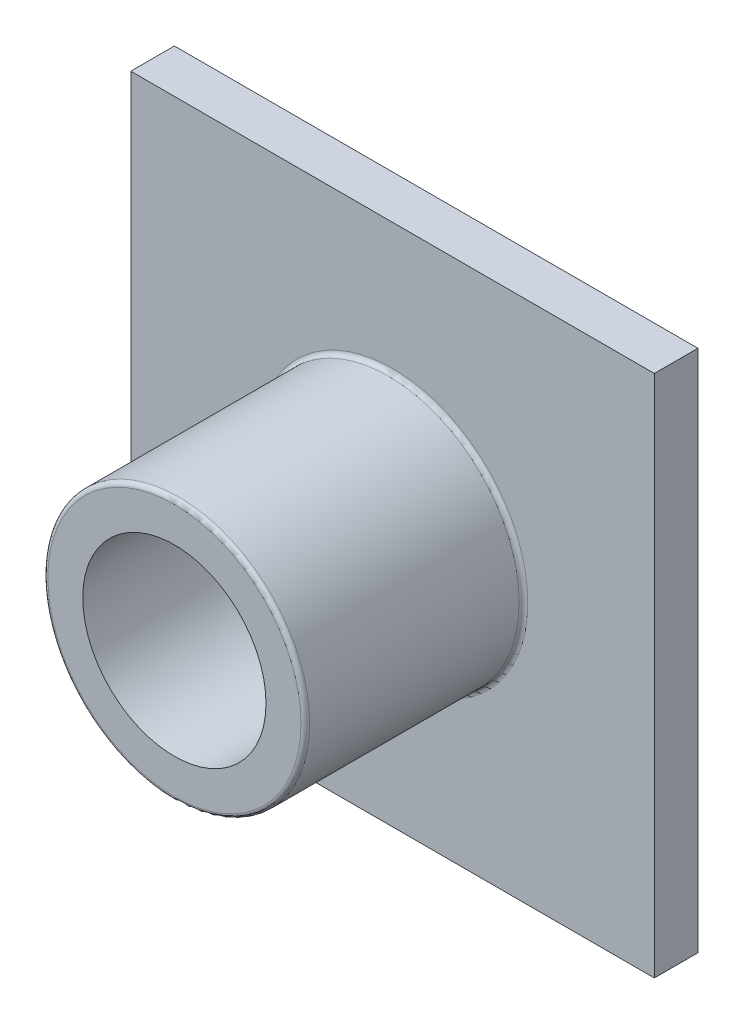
ISO-10303-21;
HEADER;
FILE_DESCRIPTION(('STEP AP214'),'2;1');
FILE_NAME('part.step','',(''),(''),'','','');
FILE_SCHEMA(('AUTOMOTIVE_DESIGN { 1 0 10303 214 1 1 1 1 }'));
ENDSEC;
DATA;
#1=APPLICATION_CONTEXT('core data for automotive mechanical design processes');
#2=APPLICATION_PROTOCOL_DEFINITION('international standard','automotive_design',2000,#1);
#3=PRODUCT_CONTEXT('',#1,'mechanical');
#4=PRODUCT('Part','Part','',(#3));
#5=PRODUCT_RELATED_PRODUCT_CATEGORY('part','',(#4));
#6=PRODUCT_DEFINITION_FORMATION('','',#4);
#7=PRODUCT_DEFINITION_CONTEXT('part definition',#1,'design');
#8=PRODUCT_DEFINITION('design','',#6,#7);
#9=PRODUCT_DEFINITION_SHAPE('','',#8);
#10=(LENGTH_UNIT() NAMED_UNIT(*) SI_UNIT(.MILLI.,.METRE.));
#11=(NAMED_UNIT(*) PLANE_ANGLE_UNIT() SI_UNIT($,.RADIAN.));
#12=(NAMED_UNIT(*) SI_UNIT($,.STERADIAN.) SOLID_ANGLE_UNIT());
#13=UNCERTAINTY_MEASURE_WITH_UNIT(LENGTH_MEASURE(1.E-05),#10,'distance_accuracy_value','');
#14=(GEOMETRIC_REPRESENTATION_CONTEXT(3) GLOBAL_UNCERTAINTY_ASSIGNED_CONTEXT((#13)) GLOBAL_UNIT_ASSIGNED_CONTEXT((#10,
#11,#12)) REPRESENTATION_CONTEXT('',''));
#15=CARTESIAN_POINT('',(0.,0.,0.));
#16=DIRECTION('',(0.,0.,1.));
#17=DIRECTION('',(1.,0.,0.));
#18=AXIS2_PLACEMENT_3D('',#15,#16,#17);
#19=CARTESIAN_POINT('',(-6.,-6.,1.));
#20=DIRECTION('',(0.,0.,1.));
#21=DIRECTION('',(1.,0.,0.));
#22=AXIS2_PLACEMENT_3D('',#19,#20,#21);
#23=PLANE('',#22);
#24=CARTESIAN_POINT('',(0.,0.,1.));
#25=DIRECTION('',(0.,0.,1.));
#26=DIRECTION('',(1.,0.,0.));
#27=AXIS2_PLACEMENT_3D('',#24,#25,#26);
#28=CIRCLE('',#27,3.1);
#29=CARTESIAN_POINT('',(3.1,0.,1.));
#30=VERTEX_POINT('',#29);
#31=EDGE_CURVE('E11',#30,#30,#28,.F.);
#32=ORIENTED_EDGE('',*,*,#31,.T.);
#33=EDGE_LOOP('',(#32));
#34=FACE_BOUND('',#33,.T.);
#35=DIRECTION('',(0.,-1.,0.));
#36=VECTOR('',#35,1.);
#37=CARTESIAN_POINT('',(-5.99999999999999,6.,1.));
#38=LINE('',#37,#36);
#39=CARTESIAN_POINT('',(-5.99999999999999,6.,1.));
#40=VERTEX_POINT('',#39);
#41=CARTESIAN_POINT('',(-6.,-6.,1.));
#42=VERTEX_POINT('',#41);
#43=EDGE_CURVE('E85',#40,#42,#38,.T.);
#44=ORIENTED_EDGE('',*,*,#43,.T.);
#45=DIRECTION('',(1.,0.,0.));
#46=VECTOR('',#45,1.);
#47=CARTESIAN_POINT('',(-6.,-6.,1.));
#48=LINE('',#47,#46);
#49=CARTESIAN_POINT('',(6.00000000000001,-6.,1.));
#50=VERTEX_POINT('',#49);
#51=EDGE_CURVE('E81',#42,#50,#48,.T.);
#52=ORIENTED_EDGE('',*,*,#51,.T.);
#53=DIRECTION('',(0.,1.,0.));
#54=VECTOR('',#53,1.);
#55=CARTESIAN_POINT('',(6.00000000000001,6.,1.));
#56=LINE('',#55,#54);
#57=CARTESIAN_POINT('',(6.00000000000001,6.,1.));
#58=VERTEX_POINT('',#57);
#59=EDGE_CURVE('E83',#50,#58,#56,.T.);
#60=ORIENTED_EDGE('',*,*,#59,.T.);
#61=DIRECTION('',(-1.,0.,0.));
#62=VECTOR('',#61,1.);
#63=CARTESIAN_POINT('',(-5.99999999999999,6.,1.));
#64=LINE('',#63,#62);
#65=EDGE_CURVE('E50',#58,#40,#64,.T.);
#66=ORIENTED_EDGE('',*,*,#65,.T.);
#67=EDGE_LOOP('',(#44,#52,#60,#66));
#68=FACE_BOUND('',#67,.T.);
#69=ADVANCED_FACE('F33',(#34,#68),#23,.T.);
#70=CARTESIAN_POINT('',(-5.99999999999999,6.,1.));
#71=DIRECTION('',(1.,0.,0.));
#72=DIRECTION('',(0.,1.,0.));
#73=AXIS2_PLACEMENT_3D('',#70,#71,#72);
#74=PLANE('',#73);
#75=DIRECTION('',(0.,-1.,0.));
#76=VECTOR('',#75,1.);
#77=CARTESIAN_POINT('',(-5.99999999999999,6.,0.));
#78=LINE('',#77,#76);
#79=CARTESIAN_POINT('',(-5.99999999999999,6.,0.));
#80=VERTEX_POINT('',#79);
#81=CARTESIAN_POINT('',(-6.,-6.,0.));
#82=VERTEX_POINT('',#81);
#83=EDGE_CURVE('E100',#80,#82,#78,.T.);
#84=ORIENTED_EDGE('',*,*,#83,.T.);
#85=DIRECTION('',(0.,0.,-1.));
#86=VECTOR('',#85,1.);
#87=CARTESIAN_POINT('',(-6.,-6.,1.));
#88=LINE('',#87,#86);
#89=EDGE_CURVE('E91',#42,#82,#88,.T.);
#90=ORIENTED_EDGE('',*,*,#89,.F.);
#91=ORIENTED_EDGE('',*,*,#43,.F.);
#92=DIRECTION('',(0.,0.,-1.));
#93=VECTOR('',#92,1.);
#94=CARTESIAN_POINT('',(-5.99999999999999,6.,1.));
#95=LINE('',#94,#93);
#96=EDGE_CURVE('E96',#40,#80,#95,.T.);
#97=ORIENTED_EDGE('',*,*,#96,.T.);
#98=EDGE_LOOP('',(#84,#90,#91,#97));
#99=FACE_BOUND('',#98,.T.);
#100=ADVANCED_FACE('F151',(#99),#74,.F.);
#101=CARTESIAN_POINT('',(-6.,-6.,1.));
#102=DIRECTION('',(0.,1.,0.));
#103=DIRECTION('',(0.,0.,1.));
#104=AXIS2_PLACEMENT_3D('',#101,#102,#103);
#105=PLANE('',#104);
#106=DIRECTION('',(1.,0.,0.));
#107=VECTOR('',#106,1.);
#108=CARTESIAN_POINT('',(-6.,-6.,0.));
#109=LINE('',#108,#107);
#110=CARTESIAN_POINT('',(6.00000000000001,-6.,0.));
#111=VERTEX_POINT('',#110);
#112=EDGE_CURVE('E90',#82,#111,#109,.T.);
#113=ORIENTED_EDGE('',*,*,#112,.T.);
#114=DIRECTION('',(0.,0.,-1.));
#115=VECTOR('',#114,1.);
#116=CARTESIAN_POINT('',(6.00000000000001,-6.,1.));
#117=LINE('',#116,#115);
#118=EDGE_CURVE('E88',#50,#111,#117,.T.);
#119=ORIENTED_EDGE('',*,*,#118,.F.);
#120=ORIENTED_EDGE('',*,*,#51,.F.);
#121=ORIENTED_EDGE('',*,*,#89,.T.);
#122=EDGE_LOOP('',(#113,#119,#120,#121));
#123=FACE_BOUND('',#122,.T.);
#124=ADVANCED_FACE('F89',(#123),#105,.F.);
#125=CARTESIAN_POINT('',(6.00000000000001,6.,1.));
#126=DIRECTION('',(-1.,0.,0.));
#127=DIRECTION('',(0.,0.,1.));
#128=AXIS2_PLACEMENT_3D('',#125,#126,#127);
#129=PLANE('',#128);
#130=DIRECTION('',(0.,1.,0.));
#131=VECTOR('',#130,1.);
#132=CARTESIAN_POINT('',(6.00000000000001,6.,0.));
#133=LINE('',#132,#131);
#134=CARTESIAN_POINT('',(6.00000000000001,6.,0.));
#135=VERTEX_POINT('',#134);
#136=EDGE_CURVE('E67',#111,#135,#133,.T.);
#137=ORIENTED_EDGE('',*,*,#136,.T.);
#138=DIRECTION('',(0.,0.,-1.));
#139=VECTOR('',#138,1.);
#140=CARTESIAN_POINT('',(6.00000000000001,6.,1.));
#141=LINE('',#140,#139);
#142=EDGE_CURVE('E92',#58,#135,#141,.T.);
#143=ORIENTED_EDGE('',*,*,#142,.F.);
#144=ORIENTED_EDGE('',*,*,#59,.F.);
#145=ORIENTED_EDGE('',*,*,#118,.T.);
#146=EDGE_LOOP('',(#137,#143,#144,#145));
#147=FACE_BOUND('',#146,.T.);
#148=ADVANCED_FACE('F94',(#147),#129,.F.);
#149=CARTESIAN_POINT('',(-5.99999999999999,6.,1.));
#150=DIRECTION('',(0.,-1.,0.));
#151=DIRECTION('',(0.,0.,-1.));
#152=AXIS2_PLACEMENT_3D('',#149,#150,#151);
#153=PLANE('',#152);
#154=DIRECTION('',(-1.,0.,0.));
#155=VECTOR('',#154,1.);
#156=CARTESIAN_POINT('',(-5.99999999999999,6.,0.));
#157=LINE('',#156,#155);
#158=EDGE_CURVE('E73',#135,#80,#157,.T.);
#159=ORIENTED_EDGE('',*,*,#158,.T.);
#160=ORIENTED_EDGE('',*,*,#96,.F.);
#161=ORIENTED_EDGE('',*,*,#65,.F.);
#162=ORIENTED_EDGE('',*,*,#142,.T.);
#163=EDGE_LOOP('',(#159,#160,#161,#162));
#164=FACE_BOUND('',#163,.T.);
#165=ADVANCED_FACE('F164',(#164),#153,.F.);
#166=CARTESIAN_POINT('',(-6.,-6.,0.));
#167=DIRECTION('',(0.,0.,1.));
#168=DIRECTION('',(1.,0.,0.));
#169=AXIS2_PLACEMENT_3D('',#166,#167,#168);
#170=PLANE('',#169);
#171=CARTESIAN_POINT('',(0.,0.,0.));
#172=DIRECTION('',(0.,0.,1.));
#173=DIRECTION('',(1.,0.,0.));
#174=AXIS2_PLACEMENT_3D('',#171,#172,#173);
#175=CIRCLE('',#174,2.7);
#176=CARTESIAN_POINT('',(2.7,0.,0.));
#177=VERTEX_POINT('',#176);
#178=EDGE_CURVE('E110',#177,#177,#175,.T.);
#179=ORIENTED_EDGE('',*,*,#178,.T.);
#180=EDGE_LOOP('',(#179));
#181=FACE_BOUND('',#180,.T.);
#182=ORIENTED_EDGE('',*,*,#83,.F.);
#183=ORIENTED_EDGE('',*,*,#158,.F.);
#184=ORIENTED_EDGE('',*,*,#136,.F.);
#185=ORIENTED_EDGE('',*,*,#112,.F.);
#186=EDGE_LOOP('',(#182,#183,#184,#185));
#187=FACE_BOUND('',#186,.T.);
#188=ADVANCED_FACE('F161',(#181,#187),#170,.F.);
#189=CARTESIAN_POINT('',(0.,0.,6.));
#190=DIRECTION('',(0.,0.,-1.));
#191=DIRECTION('',(-1.,0.,0.));
#192=AXIS2_PLACEMENT_3D('',#189,#190,#191);
#193=CYLINDRICAL_SURFACE('',#192,3.);
#194=CARTESIAN_POINT('',(0.,0.,5.9));
#195=DIRECTION('',(0.,0.,1.));
#196=DIRECTION('',(1.,0.,0.));
#197=AXIS2_PLACEMENT_3D('',#194,#195,#196);
#198=CIRCLE('',#197,3.);
#199=CARTESIAN_POINT('',(3.,0.,5.9));
#200=VERTEX_POINT('',#199);
#201=EDGE_CURVE('E42',#200,#200,#198,.F.);
#202=ORIENTED_EDGE('',*,*,#201,.T.);
#203=EDGE_LOOP('',(#202));
#204=FACE_BOUND('',#203,.T.);
#205=CARTESIAN_POINT('',(0.,0.,1.1));
#206=DIRECTION('',(0.,0.,1.));
#207=DIRECTION('',(1.,0.,0.));
#208=AXIS2_PLACEMENT_3D('',#205,#206,#207);
#209=CIRCLE('',#208,3.);
#210=CARTESIAN_POINT('',(3.,0.,1.1));
#211=VERTEX_POINT('',#210);
#212=EDGE_CURVE('E119',#211,#211,#209,.T.);
#213=ORIENTED_EDGE('',*,*,#212,.T.);
#214=EDGE_LOOP('',(#213));
#215=FACE_BOUND('',#214,.T.);
#216=ADVANCED_FACE('F124',(#204,#215),#193,.T.);
#217=CARTESIAN_POINT('',(0.,0.,6.));
#218=DIRECTION('',(0.,0.,1.));
#219=DIRECTION('',(1.,0.,0.));
#220=AXIS2_PLACEMENT_3D('',#217,#218,#219);
#221=PLANE('',#220);
#222=CARTESIAN_POINT('',(0.,0.,6.));
#223=DIRECTION('',(0.,0.,1.));
#224=DIRECTION('',(1.,0.,0.));
#225=AXIS2_PLACEMENT_3D('',#222,#223,#224);
#226=CIRCLE('',#225,2.9);
#227=CARTESIAN_POINT('',(2.9,0.,6.));
#228=VERTEX_POINT('',#227);
#229=EDGE_CURVE('E116',#228,#228,#226,.T.);
#230=ORIENTED_EDGE('',*,*,#229,.T.);
#231=EDGE_LOOP('',(#230));
#232=FACE_BOUND('',#231,.T.);
#233=CARTESIAN_POINT('',(0.,0.,6.));
#234=DIRECTION('',(0.,0.,1.));
#235=DIRECTION('',(1.,0.,0.));
#236=AXIS2_PLACEMENT_3D('',#233,#234,#235);
#237=CIRCLE('',#236,2.1);
#238=CARTESIAN_POINT('',(2.1,0.,6.));
#239=VERTEX_POINT('',#238);
#240=EDGE_CURVE('E103',#239,#239,#237,.T.);
#241=ORIENTED_EDGE('',*,*,#240,.F.);
#242=EDGE_LOOP('',(#241));
#243=FACE_BOUND('',#242,.T.);
#244=ADVANCED_FACE('F133',(#232,#243),#221,.T.);
#245=CARTESIAN_POINT('',(0.,0.,0.));
#246=DIRECTION('',(0.,0.,1.));
#247=DIRECTION('',(1.,0.,0.));
#248=AXIS2_PLACEMENT_3D('',#245,#246,#247);
#249=CYLINDRICAL_SURFACE('',#248,2.1);
#250=CARTESIAN_POINT('',(0.,0.,0.6));
#251=DIRECTION('',(0.,0.,1.));
#252=DIRECTION('',(1.,0.,0.));
#253=AXIS2_PLACEMENT_3D('',#250,#251,#252);
#254=CIRCLE('',#253,2.1);
#255=CARTESIAN_POINT('',(2.1,0.,0.6));
#256=VERTEX_POINT('',#255);
#257=EDGE_CURVE('E113',#256,#256,#254,.F.);
#258=ORIENTED_EDGE('',*,*,#257,.T.);
#259=EDGE_LOOP('',(#258));
#260=FACE_BOUND('',#259,.T.);
#261=ORIENTED_EDGE('',*,*,#240,.T.);
#262=EDGE_LOOP('',(#261));
#263=FACE_BOUND('',#262,.T.);
#264=ADVANCED_FACE('F136',(#260,#263),#249,.F.);
#265=CARTESIAN_POINT('',(0.,0.,0.6));
#266=DIRECTION('',(0.,0.,1.));
#267=DIRECTION('',(1.,0.,0.));
#268=AXIS2_PLACEMENT_3D('',#265,#266,#267);
#269=TOROIDAL_SURFACE('',#268,2.7,0.6);
#270=ORIENTED_EDGE('',*,*,#257,.F.);
#271=EDGE_LOOP('',(#270));
#272=FACE_BOUND('',#271,.T.);
#273=ORIENTED_EDGE('',*,*,#178,.F.);
#274=EDGE_LOOP('',(#273));
#275=FACE_BOUND('',#274,.T.);
#276=ADVANCED_FACE('F130',(#272,#275),#269,.T.);
#277=CARTESIAN_POINT('',(0.,0.,5.9));
#278=DIRECTION('',(0.,0.,1.));
#279=DIRECTION('',(1.,0.,0.));
#280=AXIS2_PLACEMENT_3D('',#277,#278,#279);
#281=TOROIDAL_SURFACE('',#280,2.9,0.1);
#282=ORIENTED_EDGE('',*,*,#201,.F.);
#283=EDGE_LOOP('',(#282));
#284=FACE_BOUND('',#283,.T.);
#285=ORIENTED_EDGE('',*,*,#229,.F.);
#286=EDGE_LOOP('',(#285));
#287=FACE_BOUND('',#286,.T.);
#288=ADVANCED_FACE('F127',(#284,#287),#281,.T.);
#289=CARTESIAN_POINT('',(0.,0.,1.1));
#290=DIRECTION('',(0.,0.,1.));
#291=DIRECTION('',(1.,0.,0.));
#292=AXIS2_PLACEMENT_3D('',#289,#290,#291);
#293=TOROIDAL_SURFACE('',#292,3.1,0.1);
#294=ORIENTED_EDGE('',*,*,#31,.F.);
#295=EDGE_LOOP('',(#294));
#296=FACE_BOUND('',#295,.T.);
#297=ORIENTED_EDGE('',*,*,#212,.F.);
#298=EDGE_LOOP('',(#297));
#299=FACE_BOUND('',#298,.T.);
#300=ADVANCED_FACE('F35',(#296,#299),#293,.F.);
#301=CLOSED_SHELL('',(#69,#100,#124,#148,#165,#188,#216,#244,#264,#276,#288,#300));
#302=MANIFOLD_SOLID_BREP('B2',#301);
#303=ADVANCED_BREP_SHAPE_REPRESENTATION('',(#18,#302),#14);
#304=SHAPE_DEFINITION_REPRESENTATION(#9,#303);
ENDSEC;
END-ISO-10303-21;
